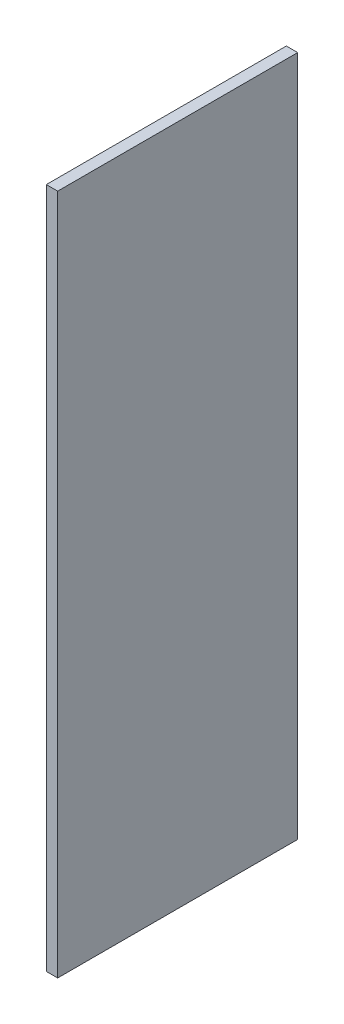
ISO-10303-21;
HEADER;
FILE_DESCRIPTION(('STEP AP214'),'2;1');
FILE_NAME('part.step','',(''),(''),'','','');
FILE_SCHEMA(('AUTOMOTIVE_DESIGN { 1 0 10303 214 1 1 1 1 }'));
ENDSEC;
DATA;
#1=APPLICATION_CONTEXT('core data for automotive mechanical design processes');
#2=APPLICATION_PROTOCOL_DEFINITION('international standard','automotive_design',2000,#1);
#3=PRODUCT_CONTEXT('',#1,'mechanical');
#4=PRODUCT('Part','Part','',(#3));
#5=PRODUCT_RELATED_PRODUCT_CATEGORY('part','',(#4));
#6=PRODUCT_DEFINITION_FORMATION('','',#4);
#7=PRODUCT_DEFINITION_CONTEXT('part definition',#1,'design');
#8=PRODUCT_DEFINITION('design','',#6,#7);
#9=PRODUCT_DEFINITION_SHAPE('','',#8);
#10=(LENGTH_UNIT() NAMED_UNIT(*) SI_UNIT(.MILLI.,.METRE.));
#11=(NAMED_UNIT(*) PLANE_ANGLE_UNIT() SI_UNIT($,.RADIAN.));
#12=(NAMED_UNIT(*) SI_UNIT($,.STERADIAN.) SOLID_ANGLE_UNIT());
#13=UNCERTAINTY_MEASURE_WITH_UNIT(LENGTH_MEASURE(1.E-05),#10,'distance_accuracy_value','');
#14=(GEOMETRIC_REPRESENTATION_CONTEXT(3) GLOBAL_UNCERTAINTY_ASSIGNED_CONTEXT((#13)) GLOBAL_UNIT_ASSIGNED_CONTEXT((#10,
#11,#12)) REPRESENTATION_CONTEXT('',''));
#15=CARTESIAN_POINT('',(0.,0.,0.));
#16=DIRECTION('',(0.,0.,1.));
#17=DIRECTION('',(1.,0.,0.));
#18=AXIS2_PLACEMENT_3D('',#15,#16,#17);
#19=CARTESIAN_POINT('',(1.5,90.,-31.7));
#20=DIRECTION('',(0.,0.,1.));
#21=DIRECTION('',(0.,-1.,0.));
#22=AXIS2_PLACEMENT_3D('',#19,#20,#21);
#23=PLANE('',#22);
#24=DIRECTION('',(0.,1.,0.));
#25=VECTOR('',#24,1.);
#26=CARTESIAN_POINT('',(-1.5,90.,-31.7));
#27=LINE('',#26,#25);
#28=CARTESIAN_POINT('',(-1.5,-90.,-31.7));
#29=VERTEX_POINT('',#28);
#30=CARTESIAN_POINT('',(-1.5,90.,-31.7));
#31=VERTEX_POINT('',#30);
#32=EDGE_CURVE('E97',#29,#31,#27,.T.);
#33=ORIENTED_EDGE('',*,*,#32,.T.);
#34=DIRECTION('',(-1.,0.,0.));
#35=VECTOR('',#34,1.);
#36=CARTESIAN_POINT('',(1.5,90.,-31.7));
#37=LINE('',#36,#35);
#38=CARTESIAN_POINT('',(1.5,90.,-31.7));
#39=VERTEX_POINT('',#38);
#40=EDGE_CURVE('E11',#39,#31,#37,.T.);
#41=ORIENTED_EDGE('',*,*,#40,.F.);
#42=DIRECTION('',(0.,1.,0.));
#43=VECTOR('',#42,1.);
#44=CARTESIAN_POINT('',(1.5,90.,-31.7));
#45=LINE('',#44,#43);
#46=CARTESIAN_POINT('',(1.5,-90.,-31.7));
#47=VERTEX_POINT('',#46);
#48=EDGE_CURVE('E85',#47,#39,#45,.T.);
#49=ORIENTED_EDGE('',*,*,#48,.F.);
#50=DIRECTION('',(-1.,0.,0.));
#51=VECTOR('',#50,1.);
#52=CARTESIAN_POINT('',(1.5,-90.,-31.7));
#53=LINE('',#52,#51);
#54=EDGE_CURVE('E93',#47,#29,#53,.T.);
#55=ORIENTED_EDGE('',*,*,#54,.T.);
#56=EDGE_LOOP('',(#33,#41,#49,#55));
#57=FACE_BOUND('',#56,.T.);
#58=ADVANCED_FACE('F34',(#57),#23,.F.);
#59=CARTESIAN_POINT('',(1.5,90.,31.7));
#60=DIRECTION('',(0.,-1.,0.));
#61=DIRECTION('',(0.,0.,-1.));
#62=AXIS2_PLACEMENT_3D('',#59,#60,#61);
#63=PLANE('',#62);
#64=DIRECTION('',(0.,0.,1.));
#65=VECTOR('',#64,1.);
#66=CARTESIAN_POINT('',(-1.5,90.,31.7));
#67=LINE('',#66,#65);
#68=CARTESIAN_POINT('',(-1.5,90.,31.7));
#69=VERTEX_POINT('',#68);
#70=EDGE_CURVE('E89',#31,#69,#67,.T.);
#71=ORIENTED_EDGE('',*,*,#70,.T.);
#72=DIRECTION('',(-1.,0.,0.));
#73=VECTOR('',#72,1.);
#74=CARTESIAN_POINT('',(1.5,90.,31.7));
#75=LINE('',#74,#73);
#76=CARTESIAN_POINT('',(1.5,90.,31.7));
#77=VERTEX_POINT('',#76);
#78=EDGE_CURVE('E42',#77,#69,#75,.T.);
#79=ORIENTED_EDGE('',*,*,#78,.F.);
#80=DIRECTION('',(0.,0.,1.));
#81=VECTOR('',#80,1.);
#82=CARTESIAN_POINT('',(1.5,90.,31.7));
#83=LINE('',#82,#81);
#84=EDGE_CURVE('E80',#39,#77,#83,.T.);
#85=ORIENTED_EDGE('',*,*,#84,.F.);
#86=ORIENTED_EDGE('',*,*,#40,.T.);
#87=EDGE_LOOP('',(#71,#79,#85,#86));
#88=FACE_BOUND('',#87,.T.);
#89=ADVANCED_FACE('F88',(#88),#63,.F.);
#90=CARTESIAN_POINT('',(1.5,90.,31.7));
#91=DIRECTION('',(0.,0.,-1.));
#92=DIRECTION('',(0.,1.,0.));
#93=AXIS2_PLACEMENT_3D('',#90,#91,#92);
#94=PLANE('',#93);
#95=DIRECTION('',(0.,-1.,0.));
#96=VECTOR('',#95,1.);
#97=CARTESIAN_POINT('',(-1.5,90.,31.7));
#98=LINE('',#97,#96);
#99=CARTESIAN_POINT('',(-1.5,-90.,31.7));
#100=VERTEX_POINT('',#99);
#101=EDGE_CURVE('E67',#69,#100,#98,.T.);
#102=ORIENTED_EDGE('',*,*,#101,.T.);
#103=DIRECTION('',(-1.,0.,0.));
#104=VECTOR('',#103,1.);
#105=CARTESIAN_POINT('',(1.5,-90.,31.7));
#106=LINE('',#105,#104);
#107=CARTESIAN_POINT('',(1.5,-90.,31.7));
#108=VERTEX_POINT('',#107);
#109=EDGE_CURVE('E90',#108,#100,#106,.T.);
#110=ORIENTED_EDGE('',*,*,#109,.F.);
#111=DIRECTION('',(0.,-1.,0.));
#112=VECTOR('',#111,1.);
#113=CARTESIAN_POINT('',(1.5,90.,31.7));
#114=LINE('',#113,#112);
#115=EDGE_CURVE('E83',#77,#108,#114,.T.);
#116=ORIENTED_EDGE('',*,*,#115,.F.);
#117=ORIENTED_EDGE('',*,*,#78,.T.);
#118=EDGE_LOOP('',(#102,#110,#116,#117));
#119=FACE_BOUND('',#118,.T.);
#120=ADVANCED_FACE('F91',(#119),#94,.F.);
#121=CARTESIAN_POINT('',(1.5,-90.,31.7));
#122=DIRECTION('',(0.,1.,0.));
#123=DIRECTION('',(0.,0.,1.));
#124=AXIS2_PLACEMENT_3D('',#121,#122,#123);
#125=PLANE('',#124);
#126=DIRECTION('',(0.,0.,-1.));
#127=VECTOR('',#126,1.);
#128=CARTESIAN_POINT('',(-1.5,-90.,31.7));
#129=LINE('',#128,#127);
#130=EDGE_CURVE('E73',#100,#29,#129,.T.);
#131=ORIENTED_EDGE('',*,*,#130,.T.);
#132=ORIENTED_EDGE('',*,*,#54,.F.);
#133=DIRECTION('',(0.,0.,-1.));
#134=VECTOR('',#133,1.);
#135=CARTESIAN_POINT('',(1.5,-90.,31.7));
#136=LINE('',#135,#134);
#137=EDGE_CURVE('E50',#108,#47,#136,.T.);
#138=ORIENTED_EDGE('',*,*,#137,.F.);
#139=ORIENTED_EDGE('',*,*,#109,.T.);
#140=EDGE_LOOP('',(#131,#132,#138,#139));
#141=FACE_BOUND('',#140,.T.);
#142=ADVANCED_FACE('F104',(#141),#125,.F.);
#143=CARTESIAN_POINT('',(1.5,0.,0.));
#144=DIRECTION('',(1.,0.,0.));
#145=DIRECTION('',(0.,0.,-1.));
#146=AXIS2_PLACEMENT_3D('',#143,#144,#145);
#147=PLANE('',#146);
#148=ORIENTED_EDGE('',*,*,#48,.T.);
#149=ORIENTED_EDGE('',*,*,#84,.T.);
#150=ORIENTED_EDGE('',*,*,#115,.T.);
#151=ORIENTED_EDGE('',*,*,#137,.T.);
#152=EDGE_LOOP('',(#148,#149,#150,#151));
#153=FACE_BOUND('',#152,.T.);
#154=ADVANCED_FACE('F81',(#153),#147,.T.);
#155=CARTESIAN_POINT('',(-1.5,0.,0.));
#156=DIRECTION('',(1.,0.,0.));
#157=DIRECTION('',(0.,0.,-1.));
#158=AXIS2_PLACEMENT_3D('',#155,#156,#157);
#159=PLANE('',#158);
#160=ORIENTED_EDGE('',*,*,#32,.F.);
#161=ORIENTED_EDGE('',*,*,#130,.F.);
#162=ORIENTED_EDGE('',*,*,#101,.F.);
#163=ORIENTED_EDGE('',*,*,#70,.F.);
#164=EDGE_LOOP('',(#160,#161,#162,#163));
#165=FACE_BOUND('',#164,.T.);
#166=ADVANCED_FACE('F107',(#165),#159,.F.);
#167=CLOSED_SHELL('',(#58,#89,#120,#142,#154,#166));
#168=MANIFOLD_SOLID_BREP('B2',#167);
#169=ADVANCED_BREP_SHAPE_REPRESENTATION('',(#18,#168),#14);
#170=SHAPE_DEFINITION_REPRESENTATION(#9,#169);
ENDSEC;
END-ISO-10303-21;
